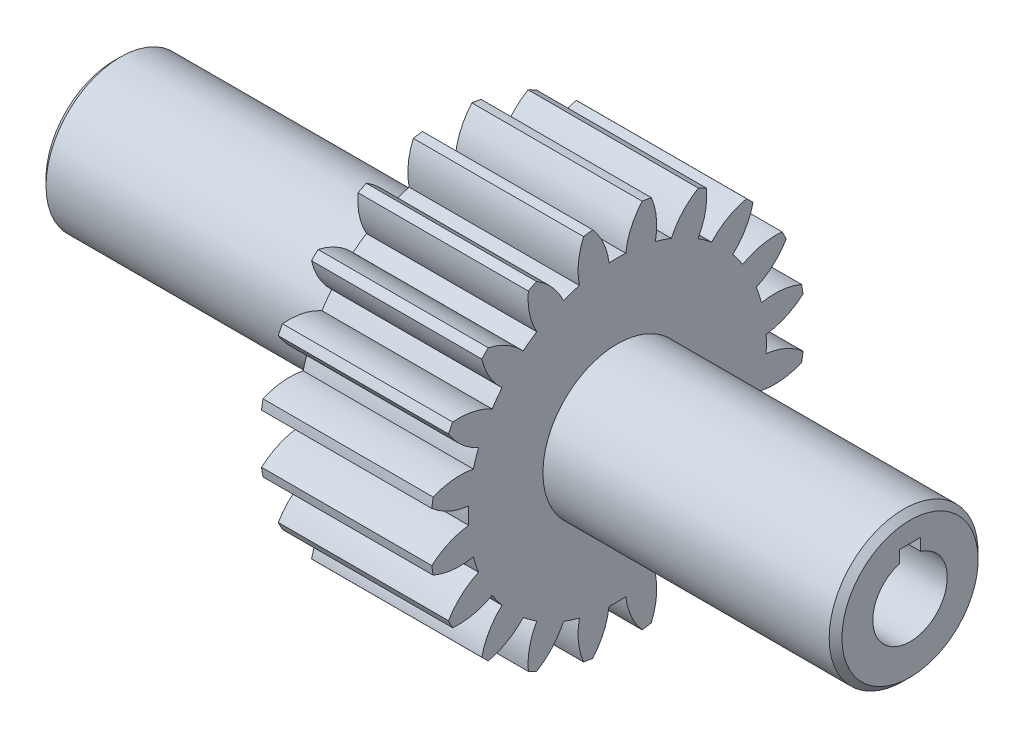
from build123d import *

# Parameters (mm, degrees)
BASPROSKE_W             = 80
BASPROSKE_H             = 88
TOOTHCUT_DEPTH          = 148.945936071
TEETHCUTS_COUNT         = 20
TEETHCUTS_ANGLE         = 342
BORSKE_R                = 35
BORE_DEPTH              = 80.0000508
BOSS_EXTRU_3_DEPTH      = 137.5
BOSS_EXTRU_3_DEPTH_BACK = 236.5
ESQUISSE4_R             = 35
CHANFREIN1_SIZE         = 3


with BuildPart() as part:
    # BasProSke → Base-Revolve (revolve)
    with BuildSketch(Plane(origin=(0, 0, 0), x_dir=(1, 0, 0), z_dir=(0, 1, 0)), mode=Mode.PRIVATE) as base_revolve_sk:
        with Locations((40, 44)):
            Rectangle(BASPROSKE_W, BASPROSKE_H)
    revolve(base_revolve_sk.sketch.rotate(Axis((-10, 0, 0), (1, 0, 0)), 180), axis=Axis((-10, 0, 0), (1, 0, 0)))

    # TooCutSke → ToothCut (cut, through all)
    with BuildSketch(Plane(origin=(0, 0, 0), x_dir=(0, 0, -1), z_dir=(1, 0, 0))):
        with BuildLine():
            ThreePointArc((3.925110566, 69.888865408), (0, 69.999), (-3.925110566, 69.888865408))
            ThreePointArc((-3.925110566, 69.888865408), (-6.467056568, 79.156548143), (-11.646013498, 87.251598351))
            ThreePointArc((-11.646013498, 87.251598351), (0, 88.0254), (11.646013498, 87.251598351))
            ThreePointArc((11.646013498, 87.251598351), (6.467056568, 79.156548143), (3.925110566, 69.888865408))
        make_face()
    toothcut = extrude(amount=TOOTHCUT_DEPTH, mode=Mode.SUBTRACT)

    # TeethCuts: ToothCut ×20 about axis
    teethcuts_axis = Axis((-10, 0, 0), (1, 0, 0))
    for i in range(1, TEETHCUTS_COUNT):
        add(toothcut.rotate(teethcuts_axis, i * TEETHCUTS_ANGLE / (TEETHCUTS_COUNT - 1)), mode=Mode.SUBTRACT)

    # BorSke → Bore (cut, symmetric)
    with BuildSketch(Plane(origin=(0, 0, 0), x_dir=(0, 0, -1), z_dir=(1, 0, 0))):
        with Locations(Location((0, 0, 0), (0, 0, 180))):
            Circle(BORSKE_R)
    extrude(amount=BORE_DEPTH, both=True, mode=Mode.SUBTRACT)


with BuildPart() as body_2:
    # Esquisse4 → Boss.-Extru.3 (new, two sides: drawn at the far end of the back side and taken through both)
    with BuildSketch(Plane(origin=(80, 0, 0), x_dir=(0, 0, -1), z_dir=(1, 0, 0)).offset(-BOSS_EXTRU_3_DEPTH_BACK)):
        Circle(ESQUISSE4_R)
        with BuildLine():
            Line((-5, 16.770509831), (-5, 22.5))
            Line((-5, 22.5), (5, 22.5))
            Line((5, 22.5), (5, 16.770509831))
            ThreePointArc((5, 16.770509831), (0, -17.5), (-5, 16.770509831))
        make_face(mode=Mode.SUBTRACT)
    extrude(amount=BOSS_EXTRU_3_DEPTH + BOSS_EXTRU_3_DEPTH_BACK)

    # Chanfrein1
    chanfrein1_edges = [body_2.edges().sort_by_distance(p)[0] for p in [
        (217.5, 0, 35),
        (-156.5, 0, 35),
    ]]
    chamfer(chanfrein1_edges, length=CHANFREIN1_SIZE)


solid = Compound([part.part, body_2.part])
